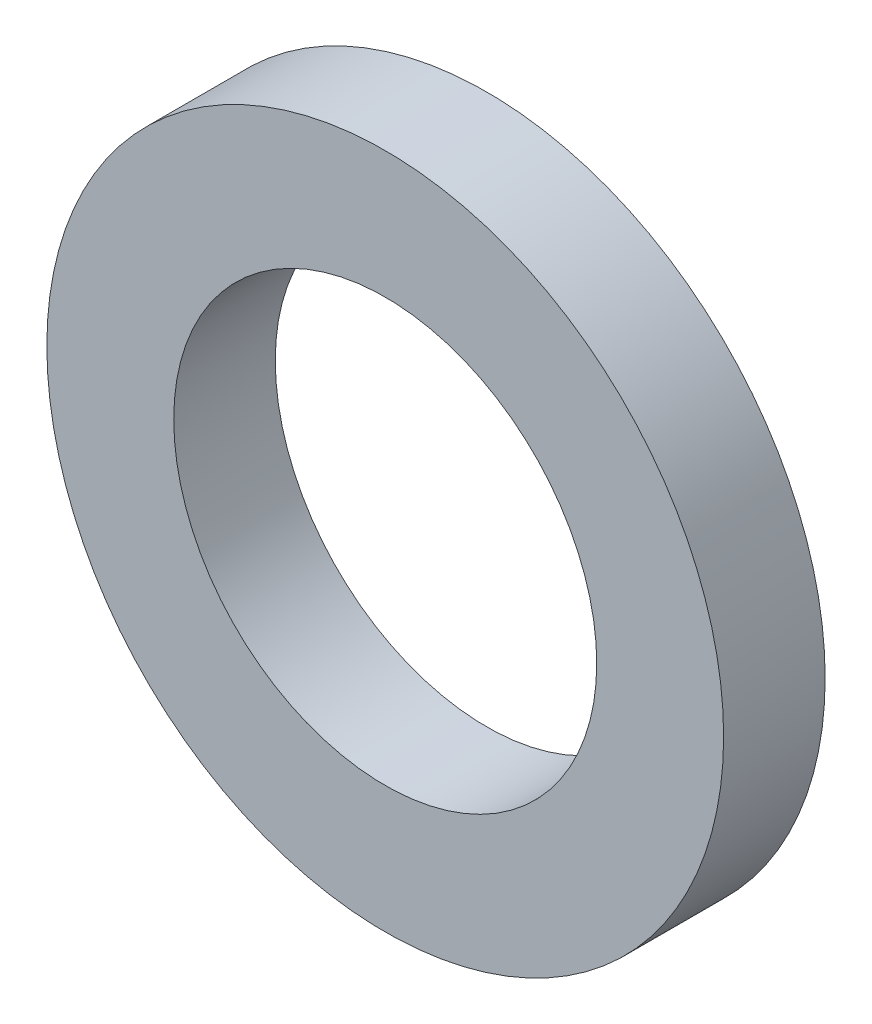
from build123d import *

# Parameters (mm, degrees)
ESQUISSE1_R        = 6
ESQUISSE1_R_2      = 3.75
BOSS_EXTRU_1_DEPTH = 1.8


with BuildPart() as part:
    # Esquisse1 → Boss.-Extru.1 (new body)
    with BuildSketch(Plane.XY):
        Circle(ESQUISSE1_R)
        Circle(ESQUISSE1_R_2, mode=Mode.SUBTRACT)
    extrude(amount=BOSS_EXTRU_1_DEPTH)


solid = part.part
